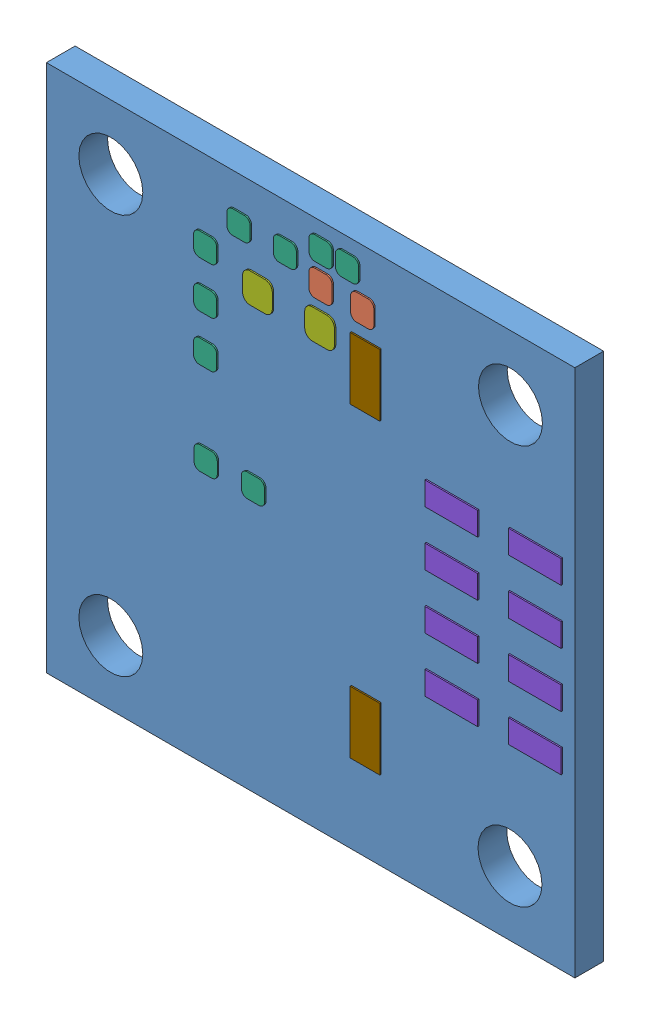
SolidWorks assembly RMB29A01-PCB-simple.SLDASM, configuration Default (file format 4400). Lengths in mm.
Overall size (28.96 28.96 1.78).
70 component instances, 9 part files, 0 mates.
Components (placement in the parent):
- Board1-1: Board1.SLDPRT [Default] at (-61.5315 -148.4884 -1.5748) size (28.96 28.96 1.57)
- RoundRectangular_125000_500000_560000__30000_0_0_0-1: RoundRectangular_125000_500000_560000__30000_0_0_0.sldprt [Default] at (-3.1369 -7.0104 -1.6637) size (1.27 1.42 0.08)
- RoundRectangular_125000_500000_560000__30000_0_0_0-2: RoundRectangular_125000_500000_560000__30000_0_0_0.sldprt [Default] at (-5.4229 -7.0104 -1.6637) size (1.27 1.42 0.08)
- RoundRectangular_125000_500000_560000__30000_0_0_0-3: RoundRectangular_125000_500000_560000__30000_0_0_0.sldprt [Default] at (3.1369 -7.5184 -1.6637) size (1.27 1.42 0.08)
- RoundRectangular_125000_500000_560000__30000_0_0_0-4: RoundRectangular_125000_500000_560000__30000_0_0_0.sldprt [Default] at (0.8509 -7.5184 -1.6637) size (1.27 1.42 0.08)
- RoundRectangular_125000_500000_560000__30000_0_0_0-5: RoundRectangular_125000_500000_560000__30000_0_0_0.sldprt [Default] at (2.1717 -5.7658 -1.6637) size (1.27 1.42 0.08)
- RoundRectangular_125000_500000_560000__30000_0_0_0-6: RoundRectangular_125000_500000_560000__30000_0_0_0.sldprt [Default] at (4.4577 -5.7658 -1.6637) size (1.27 1.42 0.08)
- RoundRectangular_125000_560000_500000__30000_0_0_0-1: RoundRectangular_125000_560000_500000__30000_0_0_0.sldprt [Default] at (5.2959 -1.27 -1.6637) size (1.42 1.27 0.08)
- RoundRectangular_125000_560000_500000__30000_0_0_0-2: RoundRectangular_125000_560000_500000__30000_0_0_0.sldprt [Default] at (5.2959 1.016 -1.6637) size (1.42 1.27 0.08)
- RoundRectangular_125000_560000_500000__30000_0_0_0-3: RoundRectangular_125000_560000_500000__30000_0_0_0.sldprt [Default] at (-7.1501 -3.4798 -1.6637) size (1.42 1.27 0.08)
- RoundRectangular_125000_560000_500000__30000_0_0_0-4: RoundRectangular_125000_560000_500000__30000_0_0_0.sldprt [Default] at (-7.1501 -1.1938 -1.6637) size (1.42 1.27 0.08)
- RoundRectangular_125000_500000_560000__30000_0_0_0-7: RoundRectangular_125000_500000_560000__30000_0_0_0.sldprt [Default] at (-4.8895 -5.2578 -1.6637) size (1.27 1.42 0.08)
- RoundRectangular_125000_500000_560000__30000_0_0_0-8: RoundRectangular_125000_500000_560000__30000_0_0_0.sldprt [Default] at (-7.1755 -5.2578 -1.6637) size (1.27 1.42 0.08)
- RoundRectangular_125000_560000_500000__30000_0_0_0-5: RoundRectangular_125000_560000_500000__30000_0_0_0.sldprt [Default] at (-1.1557 -7.7216 -1.6637) size (1.42 1.27 0.08)
- RoundRectangular_125000_560000_500000__30000_0_0_0-6: RoundRectangular_125000_560000_500000__30000_0_0_0.sldprt [Default] at (-1.1557 -5.4356 -1.6637) size (1.42 1.27 0.08)
- RoundRectangular_125000_560000_500000__30000_0_0_0-7: RoundRectangular_125000_560000_500000__30000_0_0_0.sldprt [Default] at (7.3787 0.9906 -1.6637) size (1.42 1.27 0.08)
- RoundRectangular_125000_560000_500000__30000_0_0_0-8: RoundRectangular_125000_560000_500000__30000_0_0_0.sldprt [Default] at (7.3787 -1.2954 -1.6637) size (1.42 1.27 0.08)
- RoundRectangular_125000_500000_560000__30000_0_0_0-9: RoundRectangular_125000_500000_560000__30000_0_0_0.sldprt [Default] at (0.2667 6.1468 -1.6637) size (1.27 1.42 0.08)
- RoundRectangular_125000_500000_560000__30000_0_0_0-10: RoundRectangular_125000_500000_560000__30000_0_0_0.sldprt [Default] at (2.5527 6.1468 -1.6637) size (1.27 1.42 0.08)
- RoundRectangular_35000_140000_580000__30000_0_0_0-1: RoundRectangular_35000_140000_580000__30000_0_0_0.sldprt [Default] at (-3.0607 3.5052 -1.6637) size (0.36 1.47 0.08)
- RoundRectangular_35000_140000_580000__30000_0_0_0-2: RoundRectangular_35000_140000_580000__30000_0_0_0.sldprt [Default] at (-3.6957 3.5052 -1.6637) size (0.36 1.47 0.08)
- RoundRectangular_35000_140000_580000__30000_0_0_0-3: RoundRectangular_35000_140000_580000__30000_0_0_0.sldprt [Default] at (-4.3561 3.5052 -1.6637) size (0.36 1.47 0.08)
- RoundRectangular_35000_140000_580000__30000_0_0_0-4: RoundRectangular_35000_140000_580000__30000_0_0_0.sldprt [Default] at (-4.9911 3.5052 -1.6637) size (0.36 1.47 0.08)
- RoundRectangular_35000_140000_580000__30000_0_0_0-5: RoundRectangular_35000_140000_580000__30000_0_0_0.sldprt [Default] at (-4.9657 -3.5052 -1.6637) size (0.36 1.47 0.08)
- RoundRectangular_35000_140000_580000__30000_0_0_0-6: RoundRectangular_35000_140000_580000__30000_0_0_0.sldprt [Default] at (-4.3307 -3.5052 -1.6637) size (0.36 1.47 0.08)
- RoundRectangular_35000_140000_580000__30000_0_0_0-7: RoundRectangular_35000_140000_580000__30000_0_0_0.sldprt [Default] at (-3.6703 -3.5052 -1.6637) size (0.36 1.47 0.08)
- RoundRectangular_35000_140000_580000__30000_0_0_0-8: RoundRectangular_35000_140000_580000__30000_0_0_0.sldprt [Default] at (-3.0353 -3.5052 -1.6637) size (0.36 1.47 0.08)
- 140000_580000__30000_0_0_0-1: 140000_580000__30000_0_0_0.sldprt [Default] at (3.4671 -3.5052 -1.6637) size (0.36 1.47 0.08)
- RoundRectangular_35000_140000_580000__30000_0_0_0-9: RoundRectangular_35000_140000_580000__30000_0_0_0.sldprt [Default] at (2.8067 -3.5052 -1.6637) size (0.36 1.47 0.08)
- RoundRectangular_35000_140000_580000__30000_0_0_0-10: RoundRectangular_35000_140000_580000__30000_0_0_0.sldprt [Default] at (2.1717 -3.5052 -1.6637) size (0.36 1.47 0.08)
- RoundRectangular_35000_140000_580000__30000_0_0_0-11: RoundRectangular_35000_140000_580000__30000_0_0_0.sldprt [Default] at (1.5113 -3.5052 -1.6637) size (0.36 1.47 0.08)
- RoundRectangular_35000_140000_580000__30000_0_0_0-12: RoundRectangular_35000_140000_580000__30000_0_0_0.sldprt [Default] at (0.8763 -3.5052 -1.6637) size (0.36 1.47 0.08)
- RoundRectangular_35000_140000_580000__30000_0_0_0-13: RoundRectangular_35000_140000_580000__30000_0_0_0.sldprt [Default] at (0.2159 -3.5052 -1.6637) size (0.36 1.47 0.08)
- RoundRectangular_35000_140000_580000__30000_0_0_0-14: RoundRectangular_35000_140000_580000__30000_0_0_0.sldprt [Default] at (-0.4191 -3.5052 -1.6637) size (0.36 1.47 0.08)
- RoundRectangular_35000_140000_580000__30000_0_0_0-15: RoundRectangular_35000_140000_580000__30000_0_0_0.sldprt [Default] at (-1.0795 -3.5052 -1.6637) size (0.36 1.47 0.08)
- RoundRectangular_35000_140000_580000__30000_0_0_0-16: RoundRectangular_35000_140000_580000__30000_0_0_0.sldprt [Default] at (-1.7145 -3.5052 -1.6637) size (0.36 1.47 0.08)
- RoundRectangular_35000_140000_580000__30000_0_0_0-17: RoundRectangular_35000_140000_580000__30000_0_0_0.sldprt [Default] at (-2.3749 -3.5052 -1.6637) size (0.36 1.47 0.08)
- RoundRectangular_35000_140000_580000__30000_0_0_0-18: RoundRectangular_35000_140000_580000__30000_0_0_0.sldprt [Default] at (-2.4003 3.5052 -1.6637) size (0.36 1.47 0.08)
- RoundRectangular_35000_140000_580000__30000_0_0_0-19: RoundRectangular_35000_140000_580000__30000_0_0_0.sldprt [Default] at (-1.7399 3.5052 -1.6637) size (0.36 1.47 0.08)
- RoundRectangular_35000_140000_580000__30000_0_0_0-20: RoundRectangular_35000_140000_580000__30000_0_0_0.sldprt [Default] at (-1.1049 3.5052 -1.6637) size (0.36 1.47 0.08)
- RoundRectangular_35000_140000_580000__30000_0_0_0-21: RoundRectangular_35000_140000_580000__30000_0_0_0.sldprt [Default] at (-0.4445 3.5052 -1.6637) size (0.36 1.47 0.08)
- RoundRectangular_35000_140000_580000__30000_0_0_0-22: RoundRectangular_35000_140000_580000__30000_0_0_0.sldprt [Default] at (0.1905 3.5052 -1.6637) size (0.36 1.47 0.08)
- RoundRectangular_35000_140000_580000__30000_0_0_0-23: RoundRectangular_35000_140000_580000__30000_0_0_0.sldprt [Default] at (0.8509 3.5052 -1.6637) size (0.36 1.47 0.08)
- RoundRectangular_35000_140000_580000__30000_0_0_0-24: RoundRectangular_35000_140000_580000__30000_0_0_0.sldprt [Default] at (1.4859 3.5052 -1.6637) size (0.36 1.47 0.08)
- RoundRectangular_35000_140000_580000__30000_0_0_0-25: RoundRectangular_35000_140000_580000__30000_0_0_0.sldprt [Default] at (2.1463 3.5052 -1.6637) size (0.36 1.47 0.08)
- RoundRectangular_35000_140000_580000__30000_0_0_0-26: RoundRectangular_35000_140000_580000__30000_0_0_0.sldprt [Default] at (2.7813 3.5052 -1.6637) size (0.36 1.47 0.08)
- RoundRectangular_35000_140000_580000__30000_0_0_0-27: RoundRectangular_35000_140000_580000__30000_0_0_0.sldprt [Default] at (3.4417 3.5052 -1.6637) size (0.36 1.47 0.08)
- RoundRectangular_125000_500000_500000__30000_0_0_0-1: RoundRectangular_125000_500000_500000__30000_0_0_0.sldprt [Default] at (-3.8481 0.0091 0.0098) size (1.27 1.27 0.08)
- RoundRectangular_125000_500000_500000__30000_0_0_0-2: RoundRectangular_125000_500000_500000__30000_0_0_0.sldprt [Default] at (-6.4389 0.0091 0.0098) size (1.27 1.27 0.08)
- RoundRectangular_125000_500000_500000__30000_0_0_0-3: RoundRectangular_125000_500000_500000__30000_0_0_0.sldprt [Default] at (-6.4389 5.0943 0.0388) size (1.27 1.27 0.08)
- RoundRectangular_125000_500000_500000__30000_0_0_0-4: RoundRectangular_125000_500000_500000__30000_0_0_0.sldprt [Default] at (-6.4389 7.6343 0.0388) size (1.27 1.27 0.08)
- RoundRectangular_125000_500000_500000__30000_0_0_0-5: RoundRectangular_125000_500000_500000__30000_0_0_0.sldprt [Default] at (-6.4389 10.1743 0.0388) size (1.27 1.27 0.08)
- RoundRectangular_125000_500000_500000__30000_0_0_0-6: RoundRectangular_125000_500000_500000__30000_0_0_0.sldprt [Default] at (1.3335 13.1461 0.0388) size (1.27 1.27 0.08)
- RoundRectangular_125000_500000_500000__30000_0_0_0-7: RoundRectangular_125000_500000_500000__30000_0_0_0.sldprt [Default] at (-4.6101 12.1301 0.0388) size (1.27 1.27 0.08)
- RoundRectangular_125000_500000_500000__30000_0_0_0-8: RoundRectangular_125000_500000_500000__30000_0_0_0.sldprt [Default] at (-2.0701 12.1301 0.0388) size (1.27 1.27 0.08)
- RoundRectangular_160000_640000_640000__30000_0_0_0-1: RoundRectangular_160000_640000_640000__30000_0_0_0.sldprt [Default] at (-3.5941 9.4579 0.0183) size (1.63 1.63 0.08)
- RoundRectangular_160000_640000_640000__30000_0_0_0-2: RoundRectangular_160000_640000_640000__30000_0_0_0.sldprt [Default] at (-0.1905 9.4579 0.0183) size (1.63 1.63 0.08)
- RoundRectangular_125000_500000_500000__30000_0_0_0-9: RoundRectangular_125000_500000_500000__30000_0_0_0.sldprt [Default] at (-0.1143 13.1461 0.0388) size (1.27 1.27 0.08)
- RoundRectangular_125000_500000_560000__30000_0_0_0-11: RoundRectangular_125000_500000_560000__30000_0_0_0.sldprt [Default] at (2.1463 11.4645 0.0183) size (1.27 1.42 0.08)
- RoundRectangular_125000_500000_560000__30000_0_0_0-12: RoundRectangular_125000_500000_560000__30000_0_0_0.sldprt [Default] at (-0.1397 11.4645 0.0183) size (1.27 1.42 0.08)
- 1140000_500000__30000_0_0_0-1: 1140000_500000__30000_0_0_0.sldprt [Default] at (11.5951 4.5049 0.0183) size (2.9 1.27 0.08)
- 1140000_500000__30000_0_0_0-2: 1140000_500000__30000_0_0_0.sldprt [Default] at (7.0231 4.5049 0.0183) size (2.9 1.27 0.08)
- 640000_1340000__30000_0_0_0-1: 640000_1340000__30000_0_0_0.sldprt [Default] at (2.2987 8.3911 0.0183) size (1.63 3.4 0.08)
- 1140000_500000__30000_0_0_0-3: 1140000_500000__30000_0_0_0.sldprt [Default] at (7.0231 1.5077 0.0183) size (2.9 1.27 0.08)
- 640000_1340000__30000_0_0_0-2: 640000_1340000__30000_0_0_0.sldprt [Default] at (2.2987 -8.3983 0.0183) size (1.63 3.4 0.08)
- 1140000_500000__30000_0_0_0-4: 1140000_500000__30000_0_0_0.sldprt [Default] at (7.0231 -4.4867 0.0183) size (2.9 1.27 0.08)
- 1140000_500000__30000_0_0_0-5: 1140000_500000__30000_0_0_0.sldprt [Default] at (7.0231 -1.4895 0.0183) size (2.9 1.27 0.08)
- 1140000_500000__30000_0_0_0-6: 1140000_500000__30000_0_0_0.sldprt [Default] at (11.5951 -4.4867 0.0183) size (2.9 1.27 0.08)
- 1140000_500000__30000_0_0_0-7: 1140000_500000__30000_0_0_0.sldprt [Default] at (11.5951 -1.4895 0.0183) size (2.9 1.27 0.08)
- 1140000_500000__30000_0_0_0-8: 1140000_500000__30000_0_0_0.sldprt [Default] at (11.5951 1.5077 0.0183) size (2.9 1.27 0.08)
